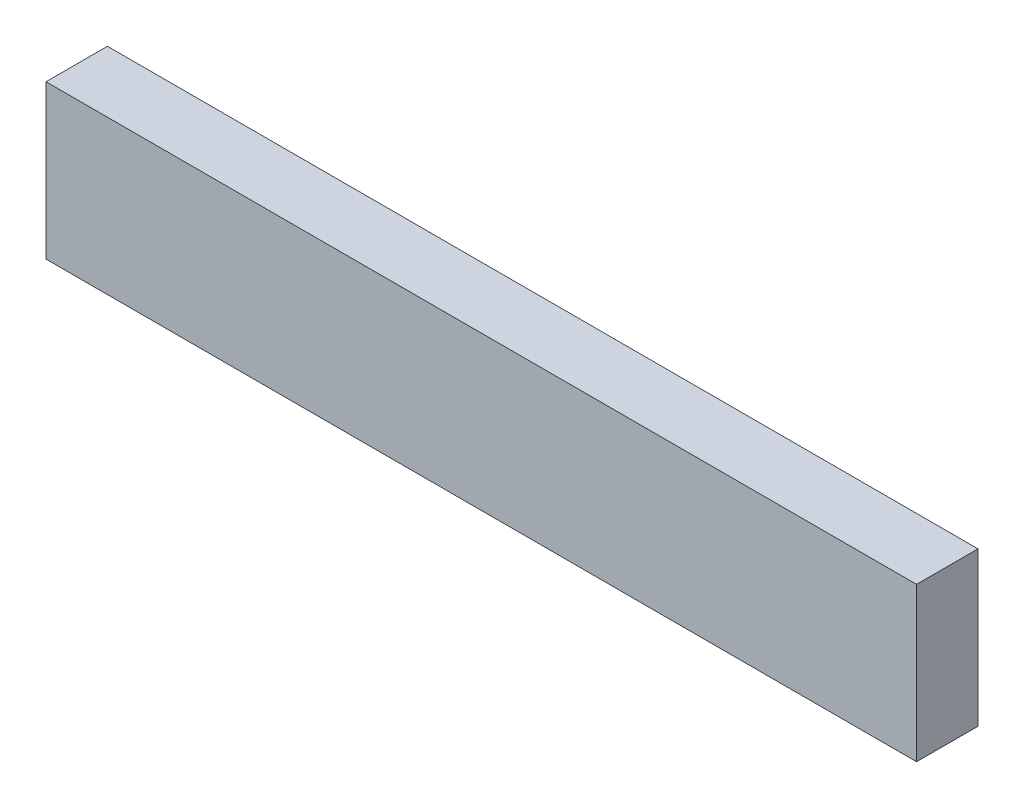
ISO-10303-21;
HEADER;
FILE_DESCRIPTION(('STEP AP214'),'2;1');
FILE_NAME('part.step','',(''),(''),'','','');
FILE_SCHEMA(('AUTOMOTIVE_DESIGN { 1 0 10303 214 1 1 1 1 }'));
ENDSEC;
DATA;
#1=APPLICATION_CONTEXT('core data for automotive mechanical design processes');
#2=APPLICATION_PROTOCOL_DEFINITION('international standard','automotive_design',2000,#1);
#3=PRODUCT_CONTEXT('',#1,'mechanical');
#4=PRODUCT('Part','Part','',(#3));
#5=PRODUCT_RELATED_PRODUCT_CATEGORY('part','',(#4));
#6=PRODUCT_DEFINITION_FORMATION('','',#4);
#7=PRODUCT_DEFINITION_CONTEXT('part definition',#1,'design');
#8=PRODUCT_DEFINITION('design','',#6,#7);
#9=PRODUCT_DEFINITION_SHAPE('','',#8);
#10=(LENGTH_UNIT() NAMED_UNIT(*) SI_UNIT(.MILLI.,.METRE.));
#11=(NAMED_UNIT(*) PLANE_ANGLE_UNIT() SI_UNIT($,.RADIAN.));
#12=(NAMED_UNIT(*) SI_UNIT($,.STERADIAN.) SOLID_ANGLE_UNIT());
#13=UNCERTAINTY_MEASURE_WITH_UNIT(LENGTH_MEASURE(1.E-05),#10,'distance_accuracy_value','');
#14=(GEOMETRIC_REPRESENTATION_CONTEXT(3) GLOBAL_UNCERTAINTY_ASSIGNED_CONTEXT((#13)) GLOBAL_UNIT_ASSIGNED_CONTEXT((#10,
#11,#12)) REPRESENTATION_CONTEXT('',''));
#15=CARTESIAN_POINT('',(0.,0.,0.));
#16=DIRECTION('',(0.,0.,1.));
#17=DIRECTION('',(1.,0.,0.));
#18=AXIS2_PLACEMENT_3D('',#15,#16,#17);
#19=CARTESIAN_POINT('',(-170.,30.,12.));
#20=DIRECTION('',(1.,0.,0.));
#21=DIRECTION('',(0.,1.,0.));
#22=AXIS2_PLACEMENT_3D('',#19,#20,#21);
#23=PLANE('',#22);
#24=DIRECTION('',(0.,-1.,0.));
#25=VECTOR('',#24,1.);
#26=CARTESIAN_POINT('',(-170.,30.,0.));
#27=LINE('',#26,#25);
#28=CARTESIAN_POINT('',(-170.,30.,0.));
#29=VERTEX_POINT('',#28);
#30=CARTESIAN_POINT('',(-170.,0.,0.));
#31=VERTEX_POINT('',#30);
#32=EDGE_CURVE('E98',#29,#31,#27,.T.);
#33=ORIENTED_EDGE('',*,*,#32,.T.);
#34=DIRECTION('',(0.,0.,-1.));
#35=VECTOR('',#34,1.);
#36=CARTESIAN_POINT('',(-170.,0.,12.));
#37=LINE('',#36,#35);
#38=CARTESIAN_POINT('',(-170.,0.,12.));
#39=VERTEX_POINT('',#38);
#40=EDGE_CURVE('E11',#39,#31,#37,.T.);
#41=ORIENTED_EDGE('',*,*,#40,.F.);
#42=DIRECTION('',(0.,-1.,0.));
#43=VECTOR('',#42,1.);
#44=CARTESIAN_POINT('',(-170.,30.,12.));
#45=LINE('',#44,#43);
#46=CARTESIAN_POINT('',(-170.,30.,12.));
#47=VERTEX_POINT('',#46);
#48=EDGE_CURVE('E86',#47,#39,#45,.T.);
#49=ORIENTED_EDGE('',*,*,#48,.F.);
#50=DIRECTION('',(0.,0.,-1.));
#51=VECTOR('',#50,1.);
#52=CARTESIAN_POINT('',(-170.,30.,12.));
#53=LINE('',#52,#51);
#54=EDGE_CURVE('E94',#47,#29,#53,.T.);
#55=ORIENTED_EDGE('',*,*,#54,.T.);
#56=EDGE_LOOP('',(#33,#41,#49,#55));
#57=FACE_BOUND('',#56,.T.);
#58=ADVANCED_FACE('F35',(#57),#23,.F.);
#59=CARTESIAN_POINT('',(-170.,0.,12.));
#60=DIRECTION('',(0.,1.,0.));
#61=DIRECTION('',(0.,0.,1.));
#62=AXIS2_PLACEMENT_3D('',#59,#60,#61);
#63=PLANE('',#62);
#64=DIRECTION('',(1.,0.,0.));
#65=VECTOR('',#64,1.);
#66=CARTESIAN_POINT('',(-170.,0.,0.));
#67=LINE('',#66,#65);
#68=CARTESIAN_POINT('',(0.,0.,0.));
#69=VERTEX_POINT('',#68);
#70=EDGE_CURVE('E90',#31,#69,#67,.T.);
#71=ORIENTED_EDGE('',*,*,#70,.T.);
#72=DIRECTION('',(0.,0.,-1.));
#73=VECTOR('',#72,1.);
#74=CARTESIAN_POINT('',(0.,0.,12.));
#75=LINE('',#74,#73);
#76=CARTESIAN_POINT('',(0.,0.,12.));
#77=VERTEX_POINT('',#76);
#78=EDGE_CURVE('E43',#77,#69,#75,.T.);
#79=ORIENTED_EDGE('',*,*,#78,.F.);
#80=DIRECTION('',(1.,0.,0.));
#81=VECTOR('',#80,1.);
#82=CARTESIAN_POINT('',(-170.,0.,12.));
#83=LINE('',#82,#81);
#84=EDGE_CURVE('E81',#39,#77,#83,.T.);
#85=ORIENTED_EDGE('',*,*,#84,.F.);
#86=ORIENTED_EDGE('',*,*,#40,.T.);
#87=EDGE_LOOP('',(#71,#79,#85,#86));
#88=FACE_BOUND('',#87,.T.);
#89=ADVANCED_FACE('F89',(#88),#63,.F.);
#90=CARTESIAN_POINT('',(0.,30.,12.));
#91=DIRECTION('',(-1.,0.,0.));
#92=DIRECTION('',(0.,-1.,0.));
#93=AXIS2_PLACEMENT_3D('',#90,#91,#92);
#94=PLANE('',#93);
#95=DIRECTION('',(0.,1.,0.));
#96=VECTOR('',#95,1.);
#97=CARTESIAN_POINT('',(0.,30.,0.));
#98=LINE('',#97,#96);
#99=CARTESIAN_POINT('',(0.,30.,0.));
#100=VERTEX_POINT('',#99);
#101=EDGE_CURVE('E68',#69,#100,#98,.T.);
#102=ORIENTED_EDGE('',*,*,#101,.T.);
#103=DIRECTION('',(0.,0.,-1.));
#104=VECTOR('',#103,1.);
#105=CARTESIAN_POINT('',(0.,30.,12.));
#106=LINE('',#105,#104);
#107=CARTESIAN_POINT('',(0.,30.,12.));
#108=VERTEX_POINT('',#107);
#109=EDGE_CURVE('E91',#108,#100,#106,.T.);
#110=ORIENTED_EDGE('',*,*,#109,.F.);
#111=DIRECTION('',(0.,1.,0.));
#112=VECTOR('',#111,1.);
#113=CARTESIAN_POINT('',(0.,30.,12.));
#114=LINE('',#113,#112);
#115=EDGE_CURVE('E84',#77,#108,#114,.T.);
#116=ORIENTED_EDGE('',*,*,#115,.F.);
#117=ORIENTED_EDGE('',*,*,#78,.T.);
#118=EDGE_LOOP('',(#102,#110,#116,#117));
#119=FACE_BOUND('',#118,.T.);
#120=ADVANCED_FACE('F92',(#119),#94,.F.);
#121=CARTESIAN_POINT('',(-170.,30.,12.));
#122=DIRECTION('',(0.,-1.,0.));
#123=DIRECTION('',(0.,0.,-1.));
#124=AXIS2_PLACEMENT_3D('',#121,#122,#123);
#125=PLANE('',#124);
#126=DIRECTION('',(-1.,0.,0.));
#127=VECTOR('',#126,1.);
#128=CARTESIAN_POINT('',(-170.,30.,0.));
#129=LINE('',#128,#127);
#130=EDGE_CURVE('E74',#100,#29,#129,.T.);
#131=ORIENTED_EDGE('',*,*,#130,.T.);
#132=ORIENTED_EDGE('',*,*,#54,.F.);
#133=DIRECTION('',(-1.,0.,0.));
#134=VECTOR('',#133,1.);
#135=CARTESIAN_POINT('',(-170.,30.,12.));
#136=LINE('',#135,#134);
#137=EDGE_CURVE('E51',#108,#47,#136,.T.);
#138=ORIENTED_EDGE('',*,*,#137,.F.);
#139=ORIENTED_EDGE('',*,*,#109,.T.);
#140=EDGE_LOOP('',(#131,#132,#138,#139));
#141=FACE_BOUND('',#140,.T.);
#142=ADVANCED_FACE('F105',(#141),#125,.F.);
#143=CARTESIAN_POINT('',(0.,0.,12.));
#144=DIRECTION('',(0.,0.,1.));
#145=DIRECTION('',(1.,0.,0.));
#146=AXIS2_PLACEMENT_3D('',#143,#144,#145);
#147=PLANE('',#146);
#148=ORIENTED_EDGE('',*,*,#48,.T.);
#149=ORIENTED_EDGE('',*,*,#84,.T.);
#150=ORIENTED_EDGE('',*,*,#115,.T.);
#151=ORIENTED_EDGE('',*,*,#137,.T.);
#152=EDGE_LOOP('',(#148,#149,#150,#151));
#153=FACE_BOUND('',#152,.T.);
#154=ADVANCED_FACE('F82',(#153),#147,.T.);
#155=CARTESIAN_POINT('',(0.,0.,0.));
#156=DIRECTION('',(0.,0.,1.));
#157=DIRECTION('',(1.,0.,0.));
#158=AXIS2_PLACEMENT_3D('',#155,#156,#157);
#159=PLANE('',#158);
#160=ORIENTED_EDGE('',*,*,#32,.F.);
#161=ORIENTED_EDGE('',*,*,#130,.F.);
#162=ORIENTED_EDGE('',*,*,#101,.F.);
#163=ORIENTED_EDGE('',*,*,#70,.F.);
#164=EDGE_LOOP('',(#160,#161,#162,#163));
#165=FACE_BOUND('',#164,.T.);
#166=ADVANCED_FACE('F108',(#165),#159,.F.);
#167=CLOSED_SHELL('',(#58,#89,#120,#142,#154,#166));
#168=MANIFOLD_SOLID_BREP('B2',#167);
#169=ADVANCED_BREP_SHAPE_REPRESENTATION('',(#18,#168),#14);
#170=SHAPE_DEFINITION_REPRESENTATION(#9,#169);
ENDSEC;
END-ISO-10303-21;
